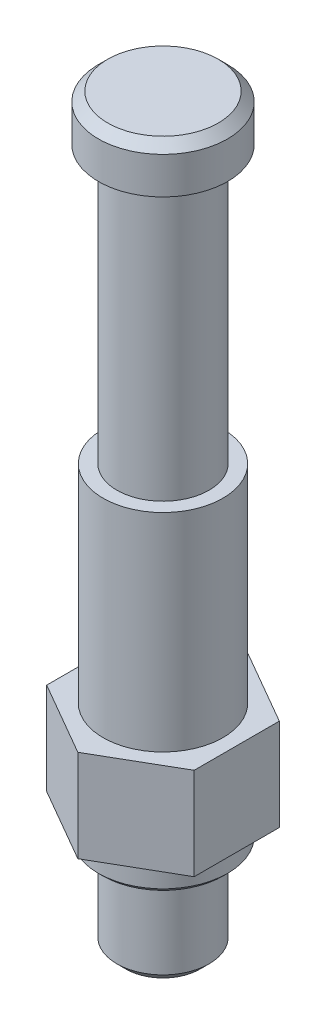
from build123d import *

# Parameters (mm, degrees)
CHANFREIN1_SIZE              = 1
CHANFREIN2_SIZE              = 0.5
ESQUISSE3_W                  = 9.494413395
ESQUISSE3_H                  = 22.552847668
ENL_V_MAT_EXTRU_1_DEPTH      = 82.732796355
R_P_TITION_CIRCULAIRE1_COUNT = 6


with BuildPart() as part:
    # Esquisse1 → R_volution2 (revolve)
    with BuildSketch(Plane.XY, mode=Mode.PRIVATE) as r_volution2_sk:
        Polygon((0, 80.5), (-7, 80.5), (-7, 75.5), (-5, 75.5), (-5, 45.5), (-6.5, 45.5), (-6.5, 23), (-10, 23), (-10, 13), (-7, 13), (-7, 10), (-5, 10), (-5, 0), (0, 0), align=None)
    revolve(r_volution2_sk.sketch.rotate(Axis((0, 0, 0), (0, 1, 0)), 270), axis=Axis((0, 0, 0), (0, 1, 0)))

    # Chanfrein1
    chanfrein1_edges = [part.edges().sort_by_distance(p)[0] for p in [
        (0, 80.5, 7),
        (0, 0, 5),
    ]]
    chamfer(chanfrein1_edges, length=CHANFREIN1_SIZE)

    # Chanfrein2
    chanfrein2_edges = [part.edges().sort_by_distance(p)[0] for p in [
        (0, 10, 7),
    ]]
    chamfer(chanfrein2_edges, length=CHANFREIN2_SIZE)

    # Esquisse3 → Enl_v. mat.-Extru.1 (cut, symmetric)
    with BuildSketch(Plane.XY):
        with Locations((-12.747206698, 22.625290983)):
            Rectangle(ESQUISSE3_W, ESQUISSE3_H)
    enl_v_mat_extru_1 = extrude(amount=ENL_V_MAT_EXTRU_1_DEPTH, both=True, mode=Mode.SUBTRACT)

    # R_p_tition circulaire1: Enl_v. mat.-Extru.1 ×6 about axis
    r_p_tition_circulaire1_axis = Axis((0, 0, 0), (0, 1, 0))
    for i in range(1, R_P_TITION_CIRCULAIRE1_COUNT):
        add(enl_v_mat_extru_1.rotate(r_p_tition_circulaire1_axis, i * 360 / R_P_TITION_CIRCULAIRE1_COUNT), mode=Mode.SUBTRACT)


solid = part.part
